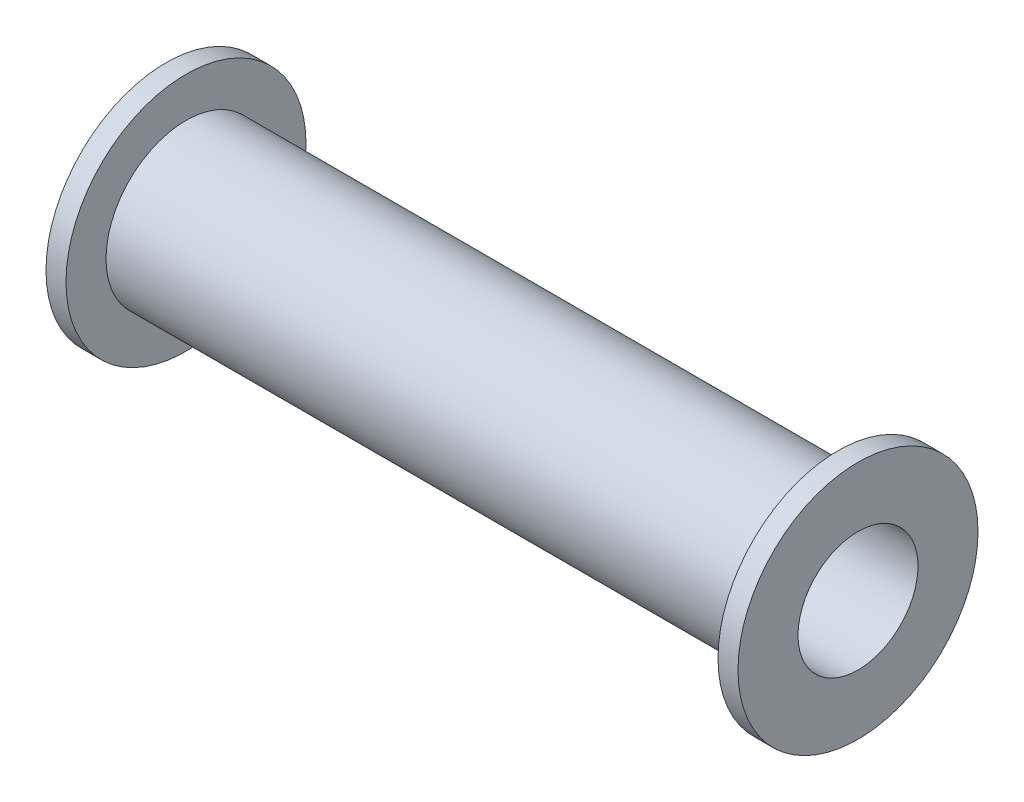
from build123d import *


with BuildPart() as part:
    # Esquisse1 → Base-R_volution (revolve)
    with BuildSketch(Plane.XY, mode=Mode.PRIVATE) as base_r_volution_sk:
        Polygon((0, 1.5), (17.3, 1.5), (17.3, 3), (16.8, 3), (16.8, 2), (0.5, 2), (0.5, 3), (0, 3), align=None)
    revolve(base_r_volution_sk.sketch.rotate(Axis((0, 0, 0), (1, 0, 0)), 90), axis=Axis((0, 0, 0), (1, 0, 0)))


solid = part.part
